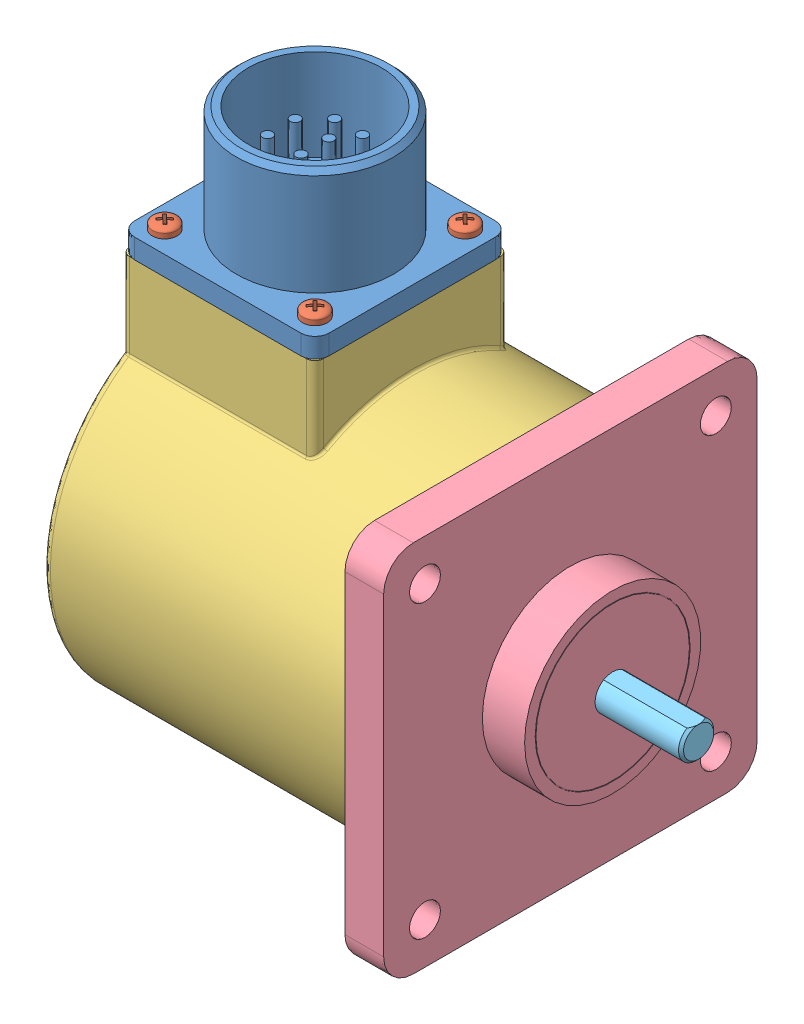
SolidWorks assembly Nidec-Avtron-AV25A1AAA1XAA.sldasm, configuration Default (file format 12000). Lengths in mm.
Overall size (86.74 98.3 67.31).
9 component instances, 5 part files, 0 mates.
Components (placement in the parent):
- Nidec-Avtron-AV25A1AAA1XAA_connectors(10 pin)-1: Nidec-Avtron-AV25A1AAA1XAA_connectors(10 pin).sldasm [Default] at (17.4625 41.91 0) size (35.05 31.88 35.05)
  - Nidec-Avtron-AV25A1AAA1XAA_10 pin connector-1: Nidec-Avtron-AV25A1AAA1XAA_10 pin connector.sldprt [Default] at (0 22.733 0) x (1 0 0) z (0 -1 0) size (35.05 35.05 22.73)
  - Nidec-Avtron-AV25A1AAA1XAA_screw3-1: Nidec-Avtron-AV25A1AAA1XAA_screw3.sldprt [Default] at (13.5382 3.556 -13.5382) x (0.700026 0 -0.714118) z (0 -1 0) size (4.45 4.45 14.42)
  - Nidec-Avtron-AV25A1AAA1XAA_screw3-2: Nidec-Avtron-AV25A1AAA1XAA_screw3.sldprt [Default] at (-13.5382 3.556 -13.5382) x (0.700026 0 -0.714118) z (0 -1 0) size (4.45 4.45 14.42)
  - Nidec-Avtron-AV25A1AAA1XAA_screw3-3: Nidec-Avtron-AV25A1AAA1XAA_screw3.sldprt [Default] at (13.5382 3.556 13.5382) x (0.700026 0 -0.714118) z (0 -1 0) size (4.45 4.45 14.42)
  - Nidec-Avtron-AV25A1AAA1XAA_screw3-4: Nidec-Avtron-AV25A1AAA1XAA_screw3.sldprt [Default] at (-13.5382 3.556 13.5382) x (0.700026 0 -0.714118) z (0 -1 0) size (4.45 4.45 14.42)
- Nidec-Avtron-AV25A1AAA1XAA_Housing(Side)-1: Nidec-Avtron-AV25A1AAA1XAA_Housing(Side).sldprt [Default] at origin size (56.64 73.66 63.5)
- Nidec-Avtron-AV25A1AAA1XAA_Flange(Square_Male_X)-1: Nidec-Avtron-AV25A1AAA1XAA_Flange(Square_Male_X).sldprt [Default] at (56.515 0 0) size (14.61 67.31 67.31)
- Nidec-Avtron-AV25A1AAA1XAA_Shaft(Flat)-1: Nidec-Avtron-AV25A1AAA1XAA_Shaft(Flat).sldprt [Default] at (63.5 0 0) size (30.73 6.35 6.35)
